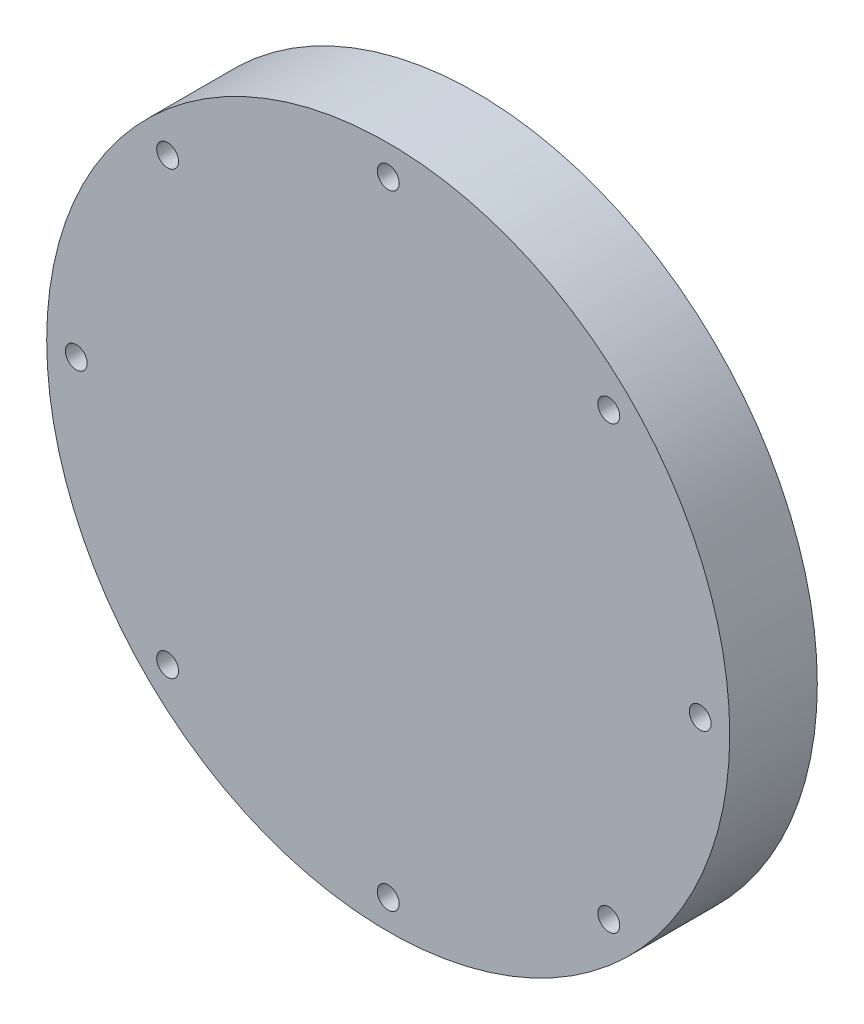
from build123d import *

# Parameters (mm, degrees)
SKETCH1_R          = 99.06
SKETCH1_R_2        = 3.175
BASE_EXTRUDE_DEPTH = 25.4


with BuildPart() as part:
    # Sketch1 → Base-Extrude (new body)
    with BuildSketch(Plane.XY):
        Circle(SKETCH1_R)
        with Locations((0, -90.4875)):
            Circle(SKETCH1_R_2, mode=Mode.SUBTRACT)
        with Locations((-63.984324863, -63.984324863)):
            Circle(SKETCH1_R_2, mode=Mode.SUBTRACT)
        with Locations((-90.4875, 0)):
            Circle(SKETCH1_R_2, mode=Mode.SUBTRACT)
        with Locations((-63.984324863, 63.984324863)):
            Circle(SKETCH1_R_2, mode=Mode.SUBTRACT)
        with Locations((0, 90.4875)):
            Circle(SKETCH1_R_2, mode=Mode.SUBTRACT)
        with Locations((63.984324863, 63.984324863)):
            Circle(SKETCH1_R_2, mode=Mode.SUBTRACT)
        with Locations((90.4875, 0)):
            Circle(SKETCH1_R_2, mode=Mode.SUBTRACT)
        with Locations((63.984324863, -63.984324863)):
            Circle(SKETCH1_R_2, mode=Mode.SUBTRACT)
    extrude(amount=BASE_EXTRUDE_DEPTH)


solid = part.part
